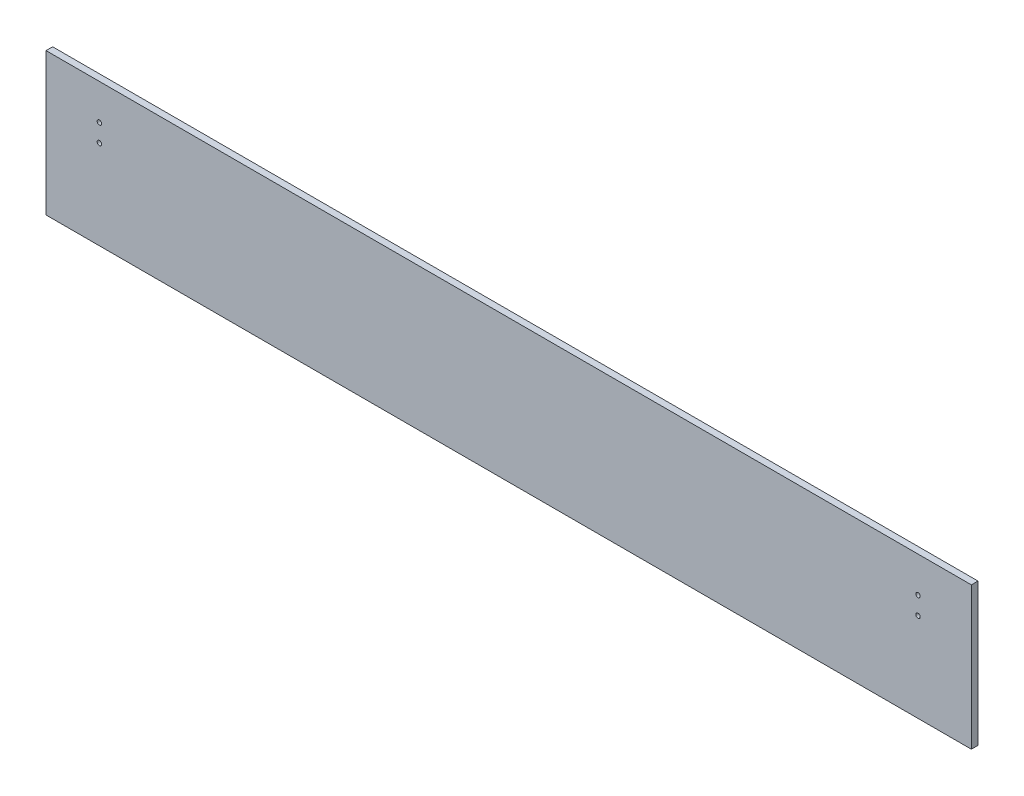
ISO-10303-21;
HEADER;
FILE_DESCRIPTION(('STEP AP214'),'2;1');
FILE_NAME('part.step','',(''),(''),'','','');
FILE_SCHEMA(('AUTOMOTIVE_DESIGN { 1 0 10303 214 1 1 1 1 }'));
ENDSEC;
DATA;
#1=APPLICATION_CONTEXT('core data for automotive mechanical design processes');
#2=APPLICATION_PROTOCOL_DEFINITION('international standard','automotive_design',2000,#1);
#3=PRODUCT_CONTEXT('',#1,'mechanical');
#4=PRODUCT('Part','Part','',(#3));
#5=PRODUCT_RELATED_PRODUCT_CATEGORY('part','',(#4));
#6=PRODUCT_DEFINITION_FORMATION('','',#4);
#7=PRODUCT_DEFINITION_CONTEXT('part definition',#1,'design');
#8=PRODUCT_DEFINITION('design','',#6,#7);
#9=PRODUCT_DEFINITION_SHAPE('','',#8);
#10=(LENGTH_UNIT() NAMED_UNIT(*) SI_UNIT(.MILLI.,.METRE.));
#11=(NAMED_UNIT(*) PLANE_ANGLE_UNIT() SI_UNIT($,.RADIAN.));
#12=(NAMED_UNIT(*) SI_UNIT($,.STERADIAN.) SOLID_ANGLE_UNIT());
#13=UNCERTAINTY_MEASURE_WITH_UNIT(LENGTH_MEASURE(1.E-05),#10,'distance_accuracy_value','');
#14=(GEOMETRIC_REPRESENTATION_CONTEXT(3) GLOBAL_UNCERTAINTY_ASSIGNED_CONTEXT((#13)) GLOBAL_UNIT_ASSIGNED_CONTEXT((#10,
#11,#12)) REPRESENTATION_CONTEXT('',''));
#15=CARTESIAN_POINT('',(0.,0.,0.));
#16=DIRECTION('',(0.,0.,1.));
#17=DIRECTION('',(1.,0.,0.));
#18=AXIS2_PLACEMENT_3D('',#15,#16,#17);
#19=CARTESIAN_POINT('',(0.,0.,2.3622));
#20=DIRECTION('',(1.,0.,0.));
#21=DIRECTION('',(0.,1.,0.));
#22=AXIS2_PLACEMENT_3D('',#19,#20,#21);
#23=PLANE('',#22);
#24=DIRECTION('',(0.,-1.,0.));
#25=VECTOR('',#24,1.);
#26=CARTESIAN_POINT('',(0.,0.,0.));
#27=LINE('',#26,#25);
#28=CARTESIAN_POINT('',(0.,0.,0.));
#29=VERTEX_POINT('',#28);
#30=CARTESIAN_POINT('',(0.,-50.8,0.));
#31=VERTEX_POINT('',#30);
#32=EDGE_CURVE('E98',#29,#31,#27,.T.);
#33=ORIENTED_EDGE('',*,*,#32,.T.);
#34=DIRECTION('',(0.,0.,-1.));
#35=VECTOR('',#34,1.);
#36=CARTESIAN_POINT('',(0.,-50.8,2.3622));
#37=LINE('',#36,#35);
#38=CARTESIAN_POINT('',(0.,-50.8,2.3622));
#39=VERTEX_POINT('',#38);
#40=EDGE_CURVE('E11',#39,#31,#37,.T.);
#41=ORIENTED_EDGE('',*,*,#40,.F.);
#42=DIRECTION('',(0.,-1.,0.));
#43=VECTOR('',#42,1.);
#44=CARTESIAN_POINT('',(0.,0.,2.3622));
#45=LINE('',#44,#43);
#46=CARTESIAN_POINT('',(0.,0.,2.3622));
#47=VERTEX_POINT('',#46);
#48=EDGE_CURVE('E86',#47,#39,#45,.T.);
#49=ORIENTED_EDGE('',*,*,#48,.F.);
#50=DIRECTION('',(0.,0.,-1.));
#51=VECTOR('',#50,1.);
#52=CARTESIAN_POINT('',(0.,0.,2.3622));
#53=LINE('',#52,#51);
#54=EDGE_CURVE('E94',#47,#29,#53,.T.);
#55=ORIENTED_EDGE('',*,*,#54,.T.);
#56=EDGE_LOOP('',(#33,#41,#49,#55));
#57=FACE_BOUND('',#56,.T.);
#58=ADVANCED_FACE('F35',(#57),#23,.F.);
#59=CARTESIAN_POINT('',(0.,-50.8,2.3622));
#60=DIRECTION('',(0.,1.,0.));
#61=DIRECTION('',(0.,0.,1.));
#62=AXIS2_PLACEMENT_3D('',#59,#60,#61);
#63=PLANE('',#62);
#64=DIRECTION('',(1.,0.,0.));
#65=VECTOR('',#64,1.);
#66=CARTESIAN_POINT('',(0.,-50.8,0.));
#67=LINE('',#66,#65);
#68=CARTESIAN_POINT('',(330.2,-50.8,0.));
#69=VERTEX_POINT('',#68);
#70=EDGE_CURVE('E90',#31,#69,#67,.T.);
#71=ORIENTED_EDGE('',*,*,#70,.T.);
#72=DIRECTION('',(0.,0.,-1.));
#73=VECTOR('',#72,1.);
#74=CARTESIAN_POINT('',(330.2,-50.8,2.3622));
#75=LINE('',#74,#73);
#76=CARTESIAN_POINT('',(330.2,-50.8,2.3622));
#77=VERTEX_POINT('',#76);
#78=EDGE_CURVE('E43',#77,#69,#75,.T.);
#79=ORIENTED_EDGE('',*,*,#78,.F.);
#80=DIRECTION('',(1.,0.,0.));
#81=VECTOR('',#80,1.);
#82=CARTESIAN_POINT('',(0.,-50.8,2.3622));
#83=LINE('',#82,#81);
#84=EDGE_CURVE('E81',#39,#77,#83,.T.);
#85=ORIENTED_EDGE('',*,*,#84,.F.);
#86=ORIENTED_EDGE('',*,*,#40,.T.);
#87=EDGE_LOOP('',(#71,#79,#85,#86));
#88=FACE_BOUND('',#87,.T.);
#89=ADVANCED_FACE('F89',(#88),#63,.F.);
#90=CARTESIAN_POINT('',(330.2,0.,2.3622));
#91=DIRECTION('',(-1.,0.,0.));
#92=DIRECTION('',(0.,0.,1.));
#93=AXIS2_PLACEMENT_3D('',#90,#91,#92);
#94=PLANE('',#93);
#95=DIRECTION('',(0.,1.,0.));
#96=VECTOR('',#95,1.);
#97=CARTESIAN_POINT('',(330.2,0.,0.));
#98=LINE('',#97,#96);
#99=CARTESIAN_POINT('',(330.2,0.,0.));
#100=VERTEX_POINT('',#99);
#101=EDGE_CURVE('E68',#69,#100,#98,.T.);
#102=ORIENTED_EDGE('',*,*,#101,.T.);
#103=DIRECTION('',(0.,0.,-1.));
#104=VECTOR('',#103,1.);
#105=CARTESIAN_POINT('',(330.2,0.,2.3622));
#106=LINE('',#105,#104);
#107=CARTESIAN_POINT('',(330.2,0.,2.3622));
#108=VERTEX_POINT('',#107);
#109=EDGE_CURVE('E91',#108,#100,#106,.T.);
#110=ORIENTED_EDGE('',*,*,#109,.F.);
#111=DIRECTION('',(0.,1.,0.));
#112=VECTOR('',#111,1.);
#113=CARTESIAN_POINT('',(330.2,0.,2.3622));
#114=LINE('',#113,#112);
#115=EDGE_CURVE('E84',#77,#108,#114,.T.);
#116=ORIENTED_EDGE('',*,*,#115,.F.);
#117=ORIENTED_EDGE('',*,*,#78,.T.);
#118=EDGE_LOOP('',(#102,#110,#116,#117));
#119=FACE_BOUND('',#118,.T.);
#120=ADVANCED_FACE('F92',(#119),#94,.F.);
#121=CARTESIAN_POINT('',(0.,0.,2.3622));
#122=DIRECTION('',(0.,-1.,0.));
#123=DIRECTION('',(0.,0.,-1.));
#124=AXIS2_PLACEMENT_3D('',#121,#122,#123);
#125=PLANE('',#124);
#126=DIRECTION('',(-1.,0.,0.));
#127=VECTOR('',#126,1.);
#128=CARTESIAN_POINT('',(0.,0.,0.));
#129=LINE('',#128,#127);
#130=EDGE_CURVE('E74',#100,#29,#129,.T.);
#131=ORIENTED_EDGE('',*,*,#130,.T.);
#132=ORIENTED_EDGE('',*,*,#54,.F.);
#133=DIRECTION('',(-1.,0.,0.));
#134=VECTOR('',#133,1.);
#135=CARTESIAN_POINT('',(0.,0.,2.3622));
#136=LINE('',#135,#134);
#137=EDGE_CURVE('E51',#108,#47,#136,.T.);
#138=ORIENTED_EDGE('',*,*,#137,.F.);
#139=ORIENTED_EDGE('',*,*,#109,.T.);
#140=EDGE_LOOP('',(#131,#132,#138,#139));
#141=FACE_BOUND('',#140,.T.);
#142=ADVANCED_FACE('F106',(#141),#125,.F.);
#143=CARTESIAN_POINT('',(0.,0.,2.3622));
#144=DIRECTION('',(0.,0.,1.));
#145=DIRECTION('',(1.,0.,0.));
#146=AXIS2_PLACEMENT_3D('',#143,#144,#145);
#147=PLANE('',#146);
#148=CARTESIAN_POINT('',(19.05,-12.7,2.3622));
#149=DIRECTION('',(0.,0.,1.));
#150=DIRECTION('',(1.,0.,0.));
#151=AXIS2_PLACEMENT_3D('',#148,#149,#150);
#152=CIRCLE('',#151,0.793749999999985);
#153=CARTESIAN_POINT('',(19.84375,-12.7,2.3622));
#154=VERTEX_POINT('',#153);
#155=EDGE_CURVE('E132',#154,#154,#152,.T.);
#156=ORIENTED_EDGE('',*,*,#155,.F.);
#157=EDGE_LOOP('',(#156));
#158=FACE_BOUND('',#157,.T.);
#159=CARTESIAN_POINT('',(19.05,-19.05,2.3622));
#160=DIRECTION('',(0.,0.,1.));
#161=DIRECTION('',(1.,0.,0.));
#162=AXIS2_PLACEMENT_3D('',#159,#160,#161);
#163=CIRCLE('',#162,0.793749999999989);
#164=CARTESIAN_POINT('',(19.84375,-19.05,2.3622));
#165=VERTEX_POINT('',#164);
#166=EDGE_CURVE('E126',#165,#165,#163,.T.);
#167=ORIENTED_EDGE('',*,*,#166,.F.);
#168=EDGE_LOOP('',(#167));
#169=FACE_BOUND('',#168,.T.);
#170=CARTESIAN_POINT('',(311.15,-12.7,2.3622));
#171=DIRECTION('',(0.,0.,1.));
#172=DIRECTION('',(1.,0.,0.));
#173=AXIS2_PLACEMENT_3D('',#170,#171,#172);
#174=CIRCLE('',#173,0.793749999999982);
#175=CARTESIAN_POINT('',(311.94375,-12.7,2.3622));
#176=VERTEX_POINT('',#175);
#177=EDGE_CURVE('E120',#176,#176,#174,.T.);
#178=ORIENTED_EDGE('',*,*,#177,.F.);
#179=EDGE_LOOP('',(#178));
#180=FACE_BOUND('',#179,.T.);
#181=CARTESIAN_POINT('',(311.15,-19.05,2.3622));
#182=DIRECTION('',(0.,0.,1.));
#183=DIRECTION('',(1.,0.,0.));
#184=AXIS2_PLACEMENT_3D('',#181,#182,#183);
#185=CIRCLE('',#184,0.793749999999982);
#186=CARTESIAN_POINT('',(311.94375,-19.05,2.3622));
#187=VERTEX_POINT('',#186);
#188=EDGE_CURVE('E114',#187,#187,#185,.T.);
#189=ORIENTED_EDGE('',*,*,#188,.F.);
#190=EDGE_LOOP('',(#189));
#191=FACE_BOUND('',#190,.T.);
#192=ORIENTED_EDGE('',*,*,#48,.T.);
#193=ORIENTED_EDGE('',*,*,#84,.T.);
#194=ORIENTED_EDGE('',*,*,#115,.T.);
#195=ORIENTED_EDGE('',*,*,#137,.T.);
#196=EDGE_LOOP('',(#192,#193,#194,#195));
#197=FACE_BOUND('',#196,.T.);
#198=ADVANCED_FACE('F82',(#158,#169,#180,#191,#197),#147,.T.);
#199=CARTESIAN_POINT('',(0.,0.,0.));
#200=DIRECTION('',(0.,0.,1.));
#201=DIRECTION('',(1.,0.,0.));
#202=AXIS2_PLACEMENT_3D('',#199,#200,#201);
#203=PLANE('',#202);
#204=CARTESIAN_POINT('',(19.05,-12.7,0.));
#205=DIRECTION('',(0.,0.,1.));
#206=DIRECTION('',(1.,0.,0.));
#207=AXIS2_PLACEMENT_3D('',#204,#205,#206);
#208=CIRCLE('',#207,0.793749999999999);
#209=CARTESIAN_POINT('',(19.84375,-12.7,0.));
#210=VERTEX_POINT('',#209);
#211=EDGE_CURVE('E129',#210,#210,#208,.T.);
#212=ORIENTED_EDGE('',*,*,#211,.T.);
#213=EDGE_LOOP('',(#212));
#214=FACE_BOUND('',#213,.T.);
#215=CARTESIAN_POINT('',(19.05,-19.05,0.));
#216=DIRECTION('',(0.,0.,1.));
#217=DIRECTION('',(1.,0.,0.));
#218=AXIS2_PLACEMENT_3D('',#215,#216,#217);
#219=CIRCLE('',#218,0.793749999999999);
#220=CARTESIAN_POINT('',(19.84375,-19.05,0.));
#221=VERTEX_POINT('',#220);
#222=EDGE_CURVE('E123',#221,#221,#219,.T.);
#223=ORIENTED_EDGE('',*,*,#222,.T.);
#224=EDGE_LOOP('',(#223));
#225=FACE_BOUND('',#224,.T.);
#226=CARTESIAN_POINT('',(311.15,-12.7,0.));
#227=DIRECTION('',(0.,0.,1.));
#228=DIRECTION('',(1.,0.,0.));
#229=AXIS2_PLACEMENT_3D('',#226,#227,#228);
#230=CIRCLE('',#229,0.793749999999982);
#231=CARTESIAN_POINT('',(311.94375,-12.7,0.));
#232=VERTEX_POINT('',#231);
#233=EDGE_CURVE('E117',#232,#232,#230,.T.);
#234=ORIENTED_EDGE('',*,*,#233,.T.);
#235=EDGE_LOOP('',(#234));
#236=FACE_BOUND('',#235,.T.);
#237=CARTESIAN_POINT('',(311.15,-19.05,0.));
#238=DIRECTION('',(0.,0.,1.));
#239=DIRECTION('',(1.,0.,0.));
#240=AXIS2_PLACEMENT_3D('',#237,#238,#239);
#241=CIRCLE('',#240,0.793749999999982);
#242=CARTESIAN_POINT('',(311.94375,-19.05,0.));
#243=VERTEX_POINT('',#242);
#244=EDGE_CURVE('E101',#243,#243,#241,.T.);
#245=ORIENTED_EDGE('',*,*,#244,.T.);
#246=EDGE_LOOP('',(#245));
#247=FACE_BOUND('',#246,.T.);
#248=ORIENTED_EDGE('',*,*,#32,.F.);
#249=ORIENTED_EDGE('',*,*,#130,.F.);
#250=ORIENTED_EDGE('',*,*,#101,.F.);
#251=ORIENTED_EDGE('',*,*,#70,.F.);
#252=EDGE_LOOP('',(#248,#249,#250,#251));
#253=FACE_BOUND('',#252,.T.);
#254=ADVANCED_FACE('F109',(#214,#225,#236,#247,#253),#203,.F.);
#255=CARTESIAN_POINT('',(311.15,-19.05,2.3622));
#256=DIRECTION('',(0.,0.,1.));
#257=DIRECTION('',(1.,0.,0.));
#258=AXIS2_PLACEMENT_3D('',#255,#256,#257);
#259=CYLINDRICAL_SURFACE('',#258,0.793749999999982);
#260=ORIENTED_EDGE('',*,*,#244,.F.);
#261=EDGE_LOOP('',(#260));
#262=FACE_BOUND('',#261,.T.);
#263=ORIENTED_EDGE('',*,*,#188,.T.);
#264=EDGE_LOOP('',(#263));
#265=FACE_BOUND('',#264,.T.);
#266=ADVANCED_FACE('F147',(#262,#265),#259,.F.);
#267=CARTESIAN_POINT('',(311.15,-12.7,2.3622));
#268=DIRECTION('',(0.,0.,1.));
#269=DIRECTION('',(1.,0.,0.));
#270=AXIS2_PLACEMENT_3D('',#267,#268,#269);
#271=CYLINDRICAL_SURFACE('',#270,0.793749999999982);
#272=ORIENTED_EDGE('',*,*,#233,.F.);
#273=EDGE_LOOP('',(#272));
#274=FACE_BOUND('',#273,.T.);
#275=ORIENTED_EDGE('',*,*,#177,.T.);
#276=EDGE_LOOP('',(#275));
#277=FACE_BOUND('',#276,.T.);
#278=ADVANCED_FACE('F149',(#274,#277),#271,.F.);
#279=CARTESIAN_POINT('',(19.05,-19.05,2.3622));
#280=DIRECTION('',(0.,0.,1.));
#281=DIRECTION('',(1.,0.,0.));
#282=AXIS2_PLACEMENT_3D('',#279,#280,#281);
#283=CYLINDRICAL_SURFACE('',#282,0.793749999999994);
#284=ORIENTED_EDGE('',*,*,#222,.F.);
#285=EDGE_LOOP('',(#284));
#286=FACE_BOUND('',#285,.T.);
#287=ORIENTED_EDGE('',*,*,#166,.T.);
#288=EDGE_LOOP('',(#287));
#289=FACE_BOUND('',#288,.T.);
#290=ADVANCED_FACE('F156',(#286,#289),#283,.F.);
#291=CARTESIAN_POINT('',(19.05,-12.7,2.3622));
#292=DIRECTION('',(0.,0.,1.));
#293=DIRECTION('',(1.,0.,0.));
#294=AXIS2_PLACEMENT_3D('',#291,#292,#293);
#295=CYLINDRICAL_SURFACE('',#294,0.793749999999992);
#296=ORIENTED_EDGE('',*,*,#211,.F.);
#297=EDGE_LOOP('',(#296));
#298=FACE_BOUND('',#297,.T.);
#299=ORIENTED_EDGE('',*,*,#155,.T.);
#300=EDGE_LOOP('',(#299));
#301=FACE_BOUND('',#300,.T.);
#302=ADVANCED_FACE('F136',(#298,#301),#295,.F.);
#303=CLOSED_SHELL('',(#58,#89,#120,#142,#198,#254,#266,#278,#290,#302));
#304=MANIFOLD_SOLID_BREP('B2',#303);
#305=ADVANCED_BREP_SHAPE_REPRESENTATION('',(#18,#304),#14);
#306=SHAPE_DEFINITION_REPRESENTATION(#9,#305);
ENDSEC;
END-ISO-10303-21;
